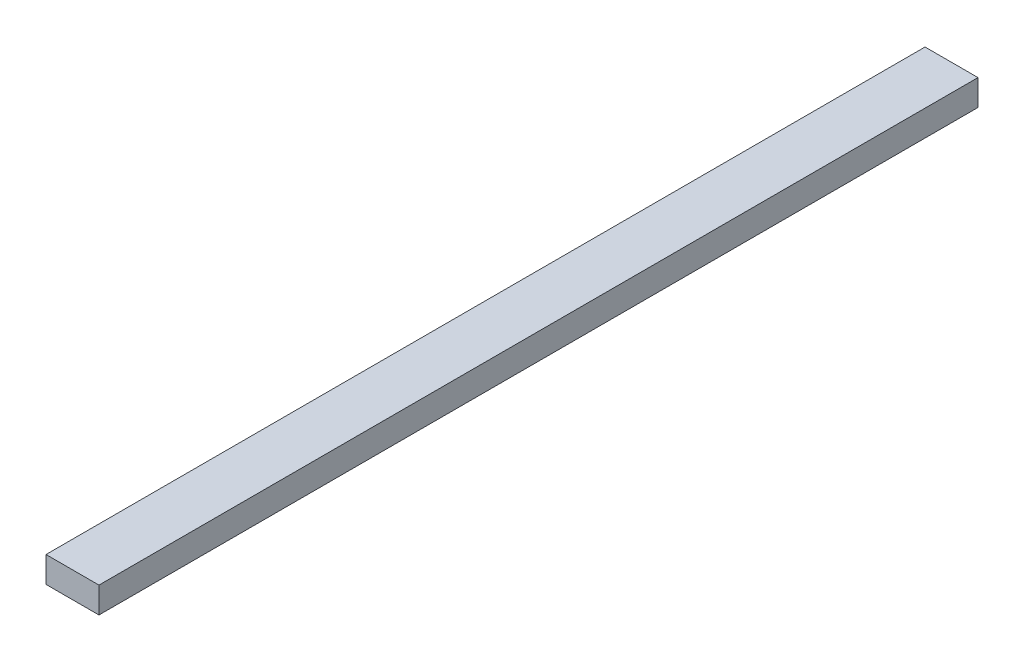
from build123d import *

# Parameters (mm, degrees)
ESQUISSE1_W        = 47
ESQUISSE1_H        = 23
BOSS_EXTRU_1_DEPTH = 780


with BuildPart() as part:
    # Esquisse1 → Boss.-Extru.1 (new body)
    with BuildSketch(Plane.XY):
        Rectangle(ESQUISSE1_W, ESQUISSE1_H)
    extrude(amount=BOSS_EXTRU_1_DEPTH)


solid = part.part
